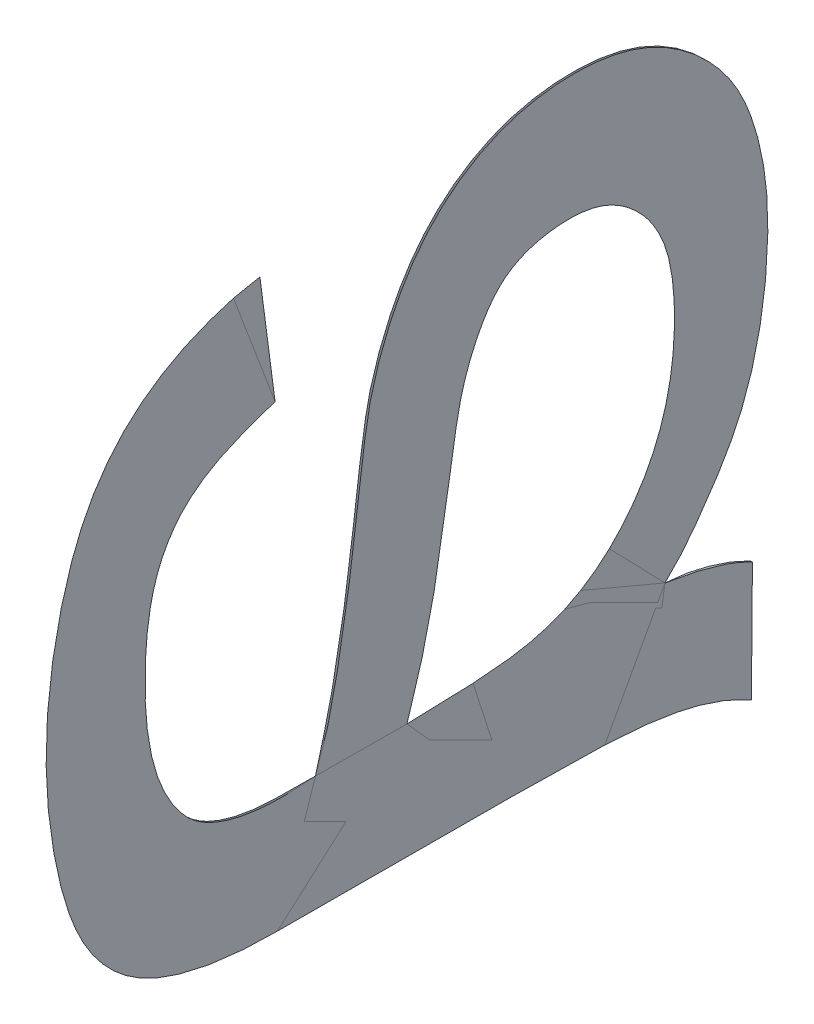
ISO-10303-21;
HEADER;
FILE_DESCRIPTION(('STEP AP214'),'2;1');
FILE_NAME('part.step','',(''),(''),'','','');
FILE_SCHEMA(('AUTOMOTIVE_DESIGN { 1 0 10303 214 1 1 1 1 }'));
ENDSEC;
DATA;
#1=APPLICATION_CONTEXT('core data for automotive mechanical design processes');
#2=APPLICATION_PROTOCOL_DEFINITION('international standard','automotive_design',2000,#1);
#3=PRODUCT_CONTEXT('',#1,'mechanical');
#4=PRODUCT('Part','Part','',(#3));
#5=PRODUCT_RELATED_PRODUCT_CATEGORY('part','',(#4));
#6=PRODUCT_DEFINITION_FORMATION('','',#4);
#7=PRODUCT_DEFINITION_CONTEXT('part definition',#1,'design');
#8=PRODUCT_DEFINITION('design','',#6,#7);
#9=PRODUCT_DEFINITION_SHAPE('','',#8);
#10=(LENGTH_UNIT() NAMED_UNIT(*) SI_UNIT(.MILLI.,.METRE.));
#11=(NAMED_UNIT(*) PLANE_ANGLE_UNIT() SI_UNIT($,.RADIAN.));
#12=(NAMED_UNIT(*) SI_UNIT($,.STERADIAN.) SOLID_ANGLE_UNIT());
#13=UNCERTAINTY_MEASURE_WITH_UNIT(LENGTH_MEASURE(1.E-05),#10,'distance_accuracy_value','');
#14=(GEOMETRIC_REPRESENTATION_CONTEXT(3) GLOBAL_UNCERTAINTY_ASSIGNED_CONTEXT((#13)) GLOBAL_UNIT_ASSIGNED_CONTEXT((#10,
#11,#12)) REPRESENTATION_CONTEXT('',''));
#15=CARTESIAN_POINT('',(0.,0.,0.));
#16=DIRECTION('',(0.,0.,1.));
#17=DIRECTION('',(1.,0.,0.));
#18=AXIS2_PLACEMENT_3D('',#15,#16,#17);
#19=CARTESIAN_POINT('',(-5.56,-3.196945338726,17.194212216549));
#20=CARTESIAN_POINT('',(-5.55,-3.196945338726,17.194212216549));
#21=CARTESIAN_POINT('',(-5.56,-3.132636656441,17.316398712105));
#22=CARTESIAN_POINT('',(-5.55,-3.132636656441,17.316398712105));
#23=CARTESIAN_POINT('',(-5.56,-3.09083601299,17.464308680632));
#24=CARTESIAN_POINT('',(-5.55,-3.09083601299,17.464308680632));
#25=CARTESIAN_POINT('',(-5.56,-3.071543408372,17.634726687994));
#26=CARTESIAN_POINT('',(-5.55,-3.071543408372,17.634726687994));
#27=B_SPLINE_SURFACE_WITH_KNOTS('',3,1,((#19,#20),(#21,#22),(#23,#24),(#25,#26)),.UNSPECIFIED.,
.F.,.F.,.F.,(4,4),(2,2),(0.973259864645,0.999999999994),(0.,1.),.UNSPECIFIED.);
#28=CARTESIAN_POINT('',(-5.56,-3.196945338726,17.194212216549));
#29=CARTESIAN_POINT('',(-5.56,-3.132636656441,17.316398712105));
#30=CARTESIAN_POINT('',(-5.56,-3.09083601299,17.464308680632));
#31=CARTESIAN_POINT('',(-5.56,-3.071543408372,17.634726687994));
#32=B_SPLINE_CURVE_WITH_KNOTS('',3,(#28,#29,#30,#31),.UNSPECIFIED.,.F.,.F.,(4,4),
(0.973259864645,0.999999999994),.UNSPECIFIED.);
#33=CARTESIAN_POINT('',(-5.555,-3.07154340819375,17.6347266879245));
#34=VERTEX_POINT('',#33);
#35=CARTESIAN_POINT('',(-5.56,-3.19694533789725,17.1942122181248));
#36=VERTEX_POINT('',#35);
#37=EDGE_CURVE('E74',#34,#36,#32,.F.);
#38=CARTESIAN_POINT('',(-5.55,-3.071543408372,17.634726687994));
#39=CARTESIAN_POINT('',(-5.55,-3.09083601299,17.464308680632));
#40=CARTESIAN_POINT('',(-5.55,-3.132636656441,17.316398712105));
#41=CARTESIAN_POINT('',(-5.55,-3.196945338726,17.194212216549));
#42=B_SPLINE_CURVE_WITH_KNOTS('',3,(#38,#39,#40,#41),.UNSPECIFIED.,.F.,.F.,(4,4),
(0.973259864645,0.999999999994),.UNSPECIFIED.);
#43=CARTESIAN_POINT('',(-5.55,-3.19694533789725,17.1942122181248));
#44=VERTEX_POINT('',#43);
#45=EDGE_CURVE('E72',#34,#44,#42,.T.);
#46=DIRECTION('',(-1.,0.,0.));
#47=VECTOR('',#46,1.);
#48=CARTESIAN_POINT('',(-5.56,-3.196945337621,17.19421221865));
#49=LINE('',#48,#47);
#50=EDGE_CURVE('E60',#36,#44,#49,.F.);
#51=ORIENTED_EDGE('',*,*,#37,.F.);
#52=ORIENTED_EDGE('',*,*,#45,.T.);
#53=ORIENTED_EDGE('',*,*,#50,.F.);
#54=EDGE_LOOP('',(#51,#52,#53));
#55=FACE_BOUND('',#54,.T.);
#56=ADVANCED_FACE('F17',(#55),#27,.T.);
#57=CARTESIAN_POINT('',(-5.56,-3.807877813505,17.19421221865));
#58=DIRECTION('',(0.,0.,-1.));
#59=DIRECTION('',(-1.,0.,0.));
#60=AXIS2_PLACEMENT_3D('',#57,#58,#59);
#61=PLANE('',#60);
#62=DIRECTION('',(0.,-1.,0.));
#63=VECTOR('',#62,1.);
#64=CARTESIAN_POINT('',(-5.56,-3.117363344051,17.19421221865));
#65=LINE('',#64,#63);
#66=CARTESIAN_POINT('',(-5.555,-3.807877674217,17.194212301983));
#67=VERTEX_POINT('',#66);
#68=EDGE_CURVE('E67',#36,#67,#65,.T.);
#69=ORIENTED_EDGE('',*,*,#68,.F.);
#70=ORIENTED_EDGE('',*,*,#50,.T.);
#71=DIRECTION('',(0.,-1.,0.));
#72=VECTOR('',#71,1.);
#73=CARTESIAN_POINT('',(-5.55,-3.117363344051,17.19421221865));
#74=LINE('',#73,#72);
#75=EDGE_CURVE('E64',#44,#67,#74,.T.);
#76=ORIENTED_EDGE('',*,*,#75,.T.);
#77=EDGE_LOOP('',(#69,#70,#76));
#78=FACE_BOUND('',#77,.T.);
#79=ADVANCED_FACE('F62',(#78),#61,.T.);
#80=CARTESIAN_POINT('',(-5.55,-1.277331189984,19.621864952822));
#81=CARTESIAN_POINT('',(-5.56,-1.277331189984,19.621864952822));
#82=CARTESIAN_POINT('',(-5.55,-1.312781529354,19.758348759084));
#83=CARTESIAN_POINT('',(-5.56,-1.312781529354,19.758348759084));
#84=CARTESIAN_POINT('',(-5.55,-1.404553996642,19.991133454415));
#85=CARTESIAN_POINT('',(-5.56,-1.404553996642,19.991133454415));
#86=CARTESIAN_POINT('',(-5.55,-1.600817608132,20.185845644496));
#87=CARTESIAN_POINT('',(-5.56,-1.600817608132,20.185845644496));
#88=CARTESIAN_POINT('',(-5.55,-1.879083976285,20.283423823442));
#89=CARTESIAN_POINT('',(-5.56,-1.879083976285,20.283423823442));
#90=CARTESIAN_POINT('',(-5.55,-2.315164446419,20.300141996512));
#91=CARTESIAN_POINT('',(-5.56,-2.315164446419,20.300141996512));
#92=CARTESIAN_POINT('',(-5.55,-2.661011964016,20.235659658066));
#93=CARTESIAN_POINT('',(-5.56,-2.661011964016,20.235659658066));
#94=CARTESIAN_POINT('',(-5.55,-2.874229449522,20.101931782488));
#95=CARTESIAN_POINT('',(-5.56,-2.874229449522,20.101931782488));
#96=CARTESIAN_POINT('',(-5.55,-2.96237233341,19.973442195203));
#97=CARTESIAN_POINT('',(-5.56,-2.96237233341,19.973442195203));
#98=CARTESIAN_POINT('',(-5.55,-3.010542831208,19.846722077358));
#99=CARTESIAN_POINT('',(-5.56,-3.010542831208,19.846722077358));
#100=CARTESIAN_POINT('',(-5.55,-3.031556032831,19.714673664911));
#101=CARTESIAN_POINT('',(-5.56,-3.031556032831,19.714673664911));
#102=CARTESIAN_POINT('',(-5.55,-3.036276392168,19.604745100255));
#103=CARTESIAN_POINT('',(-5.56,-3.036276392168,19.604745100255));
#104=CARTESIAN_POINT('',(-5.55,-3.037397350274,19.527055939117));
#105=CARTESIAN_POINT('',(-5.56,-3.037397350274,19.527055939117));
#106=CARTESIAN_POINT('',(-5.55,-3.032958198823,19.416077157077));
#107=CARTESIAN_POINT('',(-5.56,-3.032958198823,19.416077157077));
#108=B_SPLINE_SURFACE_WITH_KNOTS('',3,1,((#80,#81),(#82,#83),(#84,#85),(#86,#87),(#88,#89),(#90,
#91),(#92,#93),(#94,#95),(#96,#97),(#98,#99),(#100,#101),(#102,#103),(#104,#105),(#106,#107)),
.UNSPECIFIED.,.F.,.F.,.F.,(4,1,1,1,1,1,1,1,1,1,1,4),(2,2),(0.361874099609,0.381421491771,
0.400968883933,0.420516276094,0.440063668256,0.459611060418,0.47915845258,0.488932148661,
0.498705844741,0.508479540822,0.513366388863,0.518253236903),(0.,1.),.UNSPECIFIED.);
#109=CARTESIAN_POINT('',(-5.56,-3.032958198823,19.416077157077));
#110=CARTESIAN_POINT('',(-5.56,-3.037397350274,19.527055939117));
#111=CARTESIAN_POINT('',(-5.56,-3.036276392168,19.604745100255));
#112=CARTESIAN_POINT('',(-5.56,-3.031556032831,19.714673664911));
#113=CARTESIAN_POINT('',(-5.56,-3.010542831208,19.846722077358));
#114=CARTESIAN_POINT('',(-5.56,-2.96237233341,19.973442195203));
#115=CARTESIAN_POINT('',(-5.56,-2.874229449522,20.101931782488));
#116=CARTESIAN_POINT('',(-5.56,-2.661011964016,20.235659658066));
#117=CARTESIAN_POINT('',(-5.56,-2.315164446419,20.300141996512));
#118=CARTESIAN_POINT('',(-5.56,-1.879083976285,20.283423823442));
#119=CARTESIAN_POINT('',(-5.56,-1.600817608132,20.185845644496));
#120=CARTESIAN_POINT('',(-5.56,-1.404553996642,19.991133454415));
#121=CARTESIAN_POINT('',(-5.56,-1.312781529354,19.758348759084));
#122=CARTESIAN_POINT('',(-5.56,-1.277331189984,19.621864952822));
#123=B_SPLINE_CURVE_WITH_KNOTS('',3,(#109,#110,#111,#112,#113,#114,#115,#116,#117,#118,#119,
#120,#121,#122),.UNSPECIFIED.,.F.,.F.,(4,1,1,1,1,1,1,1,1,1,1,4),(0.361874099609,0.366760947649,
0.37164779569,0.381421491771,0.391195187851,0.400968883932,0.420516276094,0.440063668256,
0.459611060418,0.479158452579,0.498705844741,0.518253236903),.UNSPECIFIED.);
#124=CARTESIAN_POINT('',(-5.555,-1.277331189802,19.62186495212));
#125=VERTEX_POINT('',#124);
#126=CARTESIAN_POINT('',(-5.555,-3.0329581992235,19.4160771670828));
#127=VERTEX_POINT('',#126);
#128=EDGE_CURVE('E114',#125,#127,#123,.F.);
#129=CARTESIAN_POINT('',(-5.55,-1.277331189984,19.621864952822));
#130=CARTESIAN_POINT('',(-5.55,-1.312781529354,19.758348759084));
#131=CARTESIAN_POINT('',(-5.55,-1.404553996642,19.991133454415));
#132=CARTESIAN_POINT('',(-5.55,-1.600817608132,20.185845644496));
#133=CARTESIAN_POINT('',(-5.55,-1.879083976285,20.283423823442));
#134=CARTESIAN_POINT('',(-5.55,-2.315164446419,20.300141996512));
#135=CARTESIAN_POINT('',(-5.55,-2.661011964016,20.235659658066));
#136=CARTESIAN_POINT('',(-5.55,-2.874229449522,20.101931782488));
#137=CARTESIAN_POINT('',(-5.55,-2.96237233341,19.973442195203));
#138=CARTESIAN_POINT('',(-5.55,-3.010542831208,19.846722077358));
#139=CARTESIAN_POINT('',(-5.55,-3.031556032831,19.714673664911));
#140=CARTESIAN_POINT('',(-5.55,-3.036276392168,19.604745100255));
#141=CARTESIAN_POINT('',(-5.55,-3.037397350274,19.527055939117));
#142=CARTESIAN_POINT('',(-5.55,-3.032958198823,19.416077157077));
#143=B_SPLINE_CURVE_WITH_KNOTS('',3,(#129,#130,#131,#132,#133,#134,#135,#136,#137,#138,#139,
#140,#141,#142),.UNSPECIFIED.,.F.,.F.,(4,1,1,1,1,1,1,1,1,1,1,4),(0.361874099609,0.381421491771,
0.400968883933,0.420516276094,0.440063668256,0.459611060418,0.47915845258,0.488932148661,
0.498705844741,0.508479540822,0.513366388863,0.518253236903),.UNSPECIFIED.);
#144=EDGE_CURVE('E88',#125,#127,#143,.T.);
#145=ORIENTED_EDGE('',*,*,#128,.F.);
#146=ORIENTED_EDGE('',*,*,#144,.T.);
#147=EDGE_LOOP('',(#145,#146));
#148=FACE_BOUND('',#147,.T.);
#149=ADVANCED_FACE('F120',(#148),#108,.T.);
#150=CARTESIAN_POINT('',(-5.55,-3.032958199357,19.416077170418));
#151=CARTESIAN_POINT('',(-5.56,-3.032958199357,19.416077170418));
#152=CARTESIAN_POINT('',(-5.55,-2.870967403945,19.358223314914));
#153=CARTESIAN_POINT('',(-5.56,-2.870967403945,19.358223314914));
#154=CARTESIAN_POINT('',(-5.55,-2.581627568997,19.294592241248));
#155=CARTESIAN_POINT('',(-5.56,-2.581627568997,19.294592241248));
#156=CARTESIAN_POINT('',(-5.55,-2.117571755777,19.227717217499));
#157=CARTESIAN_POINT('',(-5.56,-2.117571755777,19.227717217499));
#158=CARTESIAN_POINT('',(-5.55,-1.854610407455,19.196613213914));
#159=CARTESIAN_POINT('',(-5.56,-1.854610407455,19.196613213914));
#160=CARTESIAN_POINT('',(-5.55,-1.637302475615,19.165659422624));
#161=CARTESIAN_POINT('',(-5.56,-1.637302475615,19.165659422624));
#162=CARTESIAN_POINT('',(-5.55,-1.438619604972,19.130729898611));
#163=CARTESIAN_POINT('',(-5.56,-1.438619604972,19.130729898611));
#164=CARTESIAN_POINT('',(-5.55,-1.121253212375,19.01358324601));
#165=CARTESIAN_POINT('',(-5.56,-1.121253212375,19.01358324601));
#166=CARTESIAN_POINT('',(-5.55,-0.818599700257,18.79121136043));
#167=CARTESIAN_POINT('',(-5.56,-0.818599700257,18.79121136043));
#168=CARTESIAN_POINT('',(-5.55,-0.611551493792,18.449379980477));
#169=CARTESIAN_POINT('',(-5.56,-0.611551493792,18.449379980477));
#170=CARTESIAN_POINT('',(-5.55,-0.564954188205,18.023035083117));
#171=CARTESIAN_POINT('',(-5.56,-0.564954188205,18.023035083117));
#172=CARTESIAN_POINT('',(-5.55,-0.662679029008,17.653856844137));
#173=CARTESIAN_POINT('',(-5.56,-0.662679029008,17.653856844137));
#174=CARTESIAN_POINT('',(-5.55,-0.919456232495,17.350159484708));
#175=CARTESIAN_POINT('',(-5.56,-0.919456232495,17.350159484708));
#176=CARTESIAN_POINT('',(-5.55,-1.195300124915,17.196312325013));
#177=CARTESIAN_POINT('',(-5.56,-1.195300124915,17.196312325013));
#178=CARTESIAN_POINT('',(-5.55,-1.687832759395,17.078513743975));
#179=CARTESIAN_POINT('',(-5.56,-1.687832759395,17.078513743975));
#180=CARTESIAN_POINT('',(-5.55,-2.336176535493,17.15336348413));
#181=CARTESIAN_POINT('',(-5.56,-2.336176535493,17.15336348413));
#182=CARTESIAN_POINT('',(-5.55,-2.737993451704,17.368354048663));
#183=CARTESIAN_POINT('',(-5.56,-2.737993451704,17.368354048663));
#184=CARTESIAN_POINT('',(-5.55,-2.96136535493,17.536234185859));
#185=CARTESIAN_POINT('',(-5.56,-2.96136535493,17.536234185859));
#186=CARTESIAN_POINT('',(-5.55,-3.071543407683,17.634726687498));
#187=CARTESIAN_POINT('',(-5.56,-3.071543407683,17.634726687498));
#188=B_SPLINE_SURFACE_WITH_KNOTS('',3,1,((#150,#151),(#152,#153),(#154,#155),(#156,#157),(#158,
#159),(#160,#161),(#162,#163),(#164,#165),(#166,#167),(#168,#169),(#170,#171),(#172,#173),(#174,
#175),(#176,#177),(#178,#179),(#180,#181),(#182,#183),(#184,#185),(#186,#187)),.UNSPECIFIED.,
.F.,.F.,.F.,(4,1,1,1,1,1,1,1,1,1,1,1,1,1,1,1,4),(2,2),(0.,0.04523426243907,0.05654282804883,
0.0678513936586,0.07915995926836,0.09046852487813,0.113085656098,0.135702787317,0.158319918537,
0.180937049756,0.203554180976,0.226171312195,0.248788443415,0.271405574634,0.316639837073,
0.339256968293,0.361874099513),(0.,1.),.UNSPECIFIED.);
#189=CARTESIAN_POINT('',(-5.56,-3.071543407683,17.634726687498));
#190=CARTESIAN_POINT('',(-5.56,-2.96136535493,17.536234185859));
#191=CARTESIAN_POINT('',(-5.56,-2.737993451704,17.368354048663));
#192=CARTESIAN_POINT('',(-5.56,-2.336176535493,17.15336348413));
#193=CARTESIAN_POINT('',(-5.56,-1.687832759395,17.078513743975));
#194=CARTESIAN_POINT('',(-5.56,-1.195300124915,17.196312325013));
#195=CARTESIAN_POINT('',(-5.56,-0.919456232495,17.350159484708));
#196=CARTESIAN_POINT('',(-5.56,-0.662679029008,17.653856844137));
#197=CARTESIAN_POINT('',(-5.56,-0.564954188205,18.023035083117));
#198=CARTESIAN_POINT('',(-5.56,-0.611551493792,18.449379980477));
#199=CARTESIAN_POINT('',(-5.56,-0.818599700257,18.79121136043));
#200=CARTESIAN_POINT('',(-5.56,-1.121253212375,19.01358324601));
#201=CARTESIAN_POINT('',(-5.56,-1.438619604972,19.130729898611));
#202=CARTESIAN_POINT('',(-5.56,-1.637302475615,19.165659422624));
#203=CARTESIAN_POINT('',(-5.56,-1.854610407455,19.196613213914));
#204=CARTESIAN_POINT('',(-5.56,-2.117571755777,19.227717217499));
#205=CARTESIAN_POINT('',(-5.56,-2.581627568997,19.294592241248));
#206=CARTESIAN_POINT('',(-5.56,-2.870967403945,19.358223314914));
#207=CARTESIAN_POINT('',(-5.56,-3.032958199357,19.416077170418));
#208=B_SPLINE_CURVE_WITH_KNOTS('',3,(#189,#190,#191,#192,#193,#194,#195,#196,#197,#198,#199,
#200,#201,#202,#203,#204,#205,#206,#207),.UNSPECIFIED.,.F.,.F.,(4,1,1,1,1,1,1,1,1,1,1,1,1,1,1,1,
4),(0.,0.02261713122,0.04523426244,0.090468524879,0.113085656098,0.135702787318,0.158319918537,
0.180937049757,0.203554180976,0.226171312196,0.248788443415,0.27140557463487,0.28271414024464,
0.2940227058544,0.30533127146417,0.31663983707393,0.361874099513),.UNSPECIFIED.);
#209=EDGE_CURVE('E101',#127,#34,#208,.F.);
#210=CARTESIAN_POINT('',(-5.55,-3.032958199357,19.416077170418));
#211=CARTESIAN_POINT('',(-5.55,-2.870967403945,19.358223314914));
#212=CARTESIAN_POINT('',(-5.55,-2.581627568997,19.294592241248));
#213=CARTESIAN_POINT('',(-5.55,-2.117571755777,19.227717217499));
#214=CARTESIAN_POINT('',(-5.55,-1.854610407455,19.196613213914));
#215=CARTESIAN_POINT('',(-5.55,-1.637302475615,19.165659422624));
#216=CARTESIAN_POINT('',(-5.55,-1.438619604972,19.130729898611));
#217=CARTESIAN_POINT('',(-5.55,-1.121253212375,19.01358324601));
#218=CARTESIAN_POINT('',(-5.55,-0.818599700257,18.79121136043));
#219=CARTESIAN_POINT('',(-5.55,-0.611551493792,18.449379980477));
#220=CARTESIAN_POINT('',(-5.55,-0.564954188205,18.023035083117));
#221=CARTESIAN_POINT('',(-5.55,-0.662679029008,17.653856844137));
#222=CARTESIAN_POINT('',(-5.55,-0.919456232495,17.350159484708));
#223=CARTESIAN_POINT('',(-5.55,-1.195300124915,17.196312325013));
#224=CARTESIAN_POINT('',(-5.55,-1.687832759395,17.078513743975));
#225=CARTESIAN_POINT('',(-5.55,-2.336176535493,17.15336348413));
#226=CARTESIAN_POINT('',(-5.55,-2.737993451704,17.368354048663));
#227=CARTESIAN_POINT('',(-5.55,-2.96136535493,17.536234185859));
#228=CARTESIAN_POINT('',(-5.55,-3.071543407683,17.634726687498));
#229=B_SPLINE_CURVE_WITH_KNOTS('',3,(#210,#211,#212,#213,#214,#215,#216,#217,#218,#219,#220,
#221,#222,#223,#224,#225,#226,#227,#228),.UNSPECIFIED.,.F.,.F.,(4,1,1,1,1,1,1,1,1,1,1,1,1,1,1,1,
4),(0.,0.04523426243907,0.05654282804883,0.0678513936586,0.07915995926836,0.09046852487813,
0.113085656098,0.135702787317,0.158319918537,0.180937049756,0.203554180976,0.226171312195,
0.248788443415,0.271405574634,0.316639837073,0.339256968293,0.361874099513),.UNSPECIFIED.);
#230=EDGE_CURVE('E81',#127,#34,#229,.T.);
#231=ORIENTED_EDGE('',*,*,#209,.F.);
#232=ORIENTED_EDGE('',*,*,#230,.T.);
#233=EDGE_LOOP('',(#231,#232));
#234=FACE_BOUND('',#233,.T.);
#235=ADVANCED_FACE('F19',(#234),#188,.T.);
#236=CARTESIAN_POINT('',(-5.55,-3.117363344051,17.396382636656));
#237=DIRECTION('',(-1.,0.,0.));
#238=DIRECTION('',(0.,-1.,0.));
#239=AXIS2_PLACEMENT_3D('',#236,#237,#238);
#240=PLANE('',#239);
#241=CARTESIAN_POINT('',(-5.56,-1.402733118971,17.737620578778));
#242=CARTESIAN_POINT('',(-5.56,-1.27051866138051,17.8519682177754));
#243=CARTESIAN_POINT('',(-5.56,-1.23796662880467,18.0007028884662));
#244=CARTESIAN_POINT('',(-5.56,-1.22136398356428,18.0765626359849));
#245=CARTESIAN_POINT('',(-5.56,-1.2276486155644,18.166657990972));
#246=CARTESIAN_POINT('',(-5.56,-1.23352904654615,18.2509587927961));
#247=CARTESIAN_POINT('',(-5.56,-1.2581893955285,18.3242168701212));
#248=CARTESIAN_POINT('',(-5.56,-1.28446907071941,18.402285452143));
#249=CARTESIAN_POINT('',(-5.56,-1.33418887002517,18.4585954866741));
#250=CARTESIAN_POINT('',(-5.56,-1.38076498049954,18.5113451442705));
#251=CARTESIAN_POINT('',(-5.56,-1.46123118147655,18.5580406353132));
#252=CARTESIAN_POINT('',(-5.56,-1.57691503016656,18.6251733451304));
#253=CARTESIAN_POINT('',(-5.56,-1.72169290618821,18.6648885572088));
#254=CARTESIAN_POINT('',(-5.56,-1.78202382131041,18.6814384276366));
#255=CARTESIAN_POINT('',(-5.56,-1.88444173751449,18.6988036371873));
#256=CARTESIAN_POINT('',(-5.56,-1.94318319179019,18.7087633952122));
#257=CARTESIAN_POINT('',(-5.56,-2.09876639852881,18.733232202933));
#258=CARTESIAN_POINT('',(-5.56,-2.36036304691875,18.7743739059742));
#259=CARTESIAN_POINT('',(-5.56,-2.48002097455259,18.797342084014));
#260=CARTESIAN_POINT('',(-5.56,-2.81941198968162,18.8624877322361));
#261=CARTESIAN_POINT('',(-5.56,-3.03617337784,18.949838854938));
#262=B_SPLINE_CURVE_WITH_KNOTS('',2,(#241,#242,#243,#244,#245,#246,#247,#248,#249,#250,#251,
#252,#253,#254,#255,#256,#257,#258,#259,#260,#261),.UNSPECIFIED.,.F.,.F.,(3,2,2,2,2,2,2,2,2,2,
3),(0.,0.125,0.1875,0.25,0.321428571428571,0.392857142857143,0.5,0.5625,0.625,0.75,1.),.UNSPECIFIED.);
#263=CARTESIAN_POINT('',(-5.555,-1.402733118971,17.737620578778));
#264=VERTEX_POINT('',#263);
#265=CARTESIAN_POINT('',(-5.555,-3.03617337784,18.949838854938));
#266=VERTEX_POINT('',#265);
#267=EDGE_CURVE('E11',#264,#266,#262,.T.);
#268=ORIENTED_EDGE('',*,*,#267,.F.);
#269=CARTESIAN_POINT('',(-5.56,-3.03617337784,18.949838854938));
#270=CARTESIAN_POINT('',(-5.56,-3.03136296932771,18.6274905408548));
#271=CARTESIAN_POINT('',(-5.56,-3.02975155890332,18.5977643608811));
#272=CARTESIAN_POINT('',(-5.56,-3.01904449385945,18.4002478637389));
#273=CARTESIAN_POINT('',(-5.56,-2.98315725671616,18.2680828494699));
#274=CARTESIAN_POINT('',(-5.56,-2.90340645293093,17.9743777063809));
#275=CARTESIAN_POINT('',(-5.56,-2.63198054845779,17.7825147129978));
#276=CARTESIAN_POINT('',(-5.56,-2.37869515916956,17.6034747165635));
#277=CARTESIAN_POINT('',(-5.56,-2.02370172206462,17.5837806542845));
#278=CARTESIAN_POINT('',(-5.56,-1.81836840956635,17.5723893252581));
#279=CARTESIAN_POINT('',(-5.56,-1.66285841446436,17.6084508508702));
#280=CARTESIAN_POINT('',(-5.56,-1.5115035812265,17.6435488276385));
#281=CARTESIAN_POINT('',(-5.56,-1.402733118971,17.737620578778));
#282=B_SPLINE_CURVE_WITH_KNOTS('',2,(#269,#270,#271,#272,#273,#274,#275,#276,#277,#278,#279,
#280,#281),.UNSPECIFIED.,.F.,.F.,(3,2,2,2,2,2,3),(0.,0.125,0.25,0.5,0.75,0.875,1.),.UNSPECIFIED.);
#283=EDGE_CURVE('E31',#266,#264,#282,.T.);
#284=ORIENTED_EDGE('',*,*,#283,.F.);
#285=EDGE_LOOP('',(#268,#284));
#286=FACE_BOUND('',#285,.T.);
#287=ORIENTED_EDGE('',*,*,#230,.F.);
#288=ORIENTED_EDGE('',*,*,#144,.F.);
#289=CARTESIAN_POINT('',(-5.56,-0.688907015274,19.699035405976));
#290=DIRECTION('',(0.,-0.991509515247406,-0.130034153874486));
#291=VECTOR('',#290,1.);
#292=LINE('',#289,#291);
#293=CARTESIAN_POINT('',(-5.555,-0.688907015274,19.699035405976));
#294=VERTEX_POINT('',#293);
#295=EDGE_CURVE('E223',#294,#125,#292,.T.);
#296=ORIENTED_EDGE('',*,*,#295,.F.);
#297=CARTESIAN_POINT('',(-5.56,-3.807877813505,17.19421221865));
#298=CARTESIAN_POINT('',(-5.56,-3.73186062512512,17.3358806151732));
#299=CARTESIAN_POINT('',(-5.56,-3.69377414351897,17.4951443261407));
#300=CARTESIAN_POINT('',(-5.56,-3.65554916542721,17.654987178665));
#301=CARTESIAN_POINT('',(-5.56,-3.64247592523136,17.8555986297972));
#302=CARTESIAN_POINT('',(-5.56,-3.62861985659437,18.0682227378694));
#303=CARTESIAN_POINT('',(-5.56,-3.6278135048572,18.8249934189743));
#304=CARTESIAN_POINT('',(-5.56,-3.62694240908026,19.6425271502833));
#305=CARTESIAN_POINT('',(-5.56,-3.6239040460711,19.7092800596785));
#306=CARTESIAN_POINT('',(-5.56,-3.61791538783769,19.8408510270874));
#307=CARTESIAN_POINT('',(-5.56,-3.6042305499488,19.9270893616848));
#308=CARTESIAN_POINT('',(-5.56,-3.5882672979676,20.0276856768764));
#309=CARTESIAN_POINT('',(-5.56,-3.56175645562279,20.1166843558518));
#310=CARTESIAN_POINT('',(-5.56,-3.50987723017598,20.2908464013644));
#311=CARTESIAN_POINT('',(-5.56,-3.40840647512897,20.4112313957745));
#312=CARTESIAN_POINT('',(-5.56,-3.29624906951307,20.5442950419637));
#313=CARTESIAN_POINT('',(-5.56,-3.12215321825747,20.6244048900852));
#314=CARTESIAN_POINT('',(-5.56,-2.9533942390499,20.7020589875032));
#315=CARTESIAN_POINT('',(-5.56,-2.6953807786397,20.7468933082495));
#316=CARTESIAN_POINT('',(-5.56,-2.25630814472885,20.8231898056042));
#317=CARTESIAN_POINT('',(-5.56,-1.81127456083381,20.7413472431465));
#318=CARTESIAN_POINT('',(-5.56,-1.56509046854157,20.6960734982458));
#319=CARTESIAN_POINT('',(-5.56,-1.38283008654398,20.6195350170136));
#320=CARTESIAN_POINT('',(-5.56,-1.19351283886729,20.5400330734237));
#321=CARTESIAN_POINT('',(-5.56,-1.05552343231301,20.4130878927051));
#322=CARTESIAN_POINT('',(-5.56,-0.918969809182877,20.2874635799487));
#323=CARTESIAN_POINT('',(-5.56,-0.828386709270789,20.1112840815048));
#324=CARTESIAN_POINT('',(-5.56,-0.738066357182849,19.9356156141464));
#325=CARTESIAN_POINT('',(-5.56,-0.688907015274,19.699035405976));
#326=B_SPLINE_CURVE_WITH_KNOTS('',2,(#297,#298,#299,#300,#301,#302,#303,#304,#305,#306,#307,
#308,#309,#310,#311,#312,#313,#314,#315,#316,#317,#318,#319,#320,#321,#322,#323,#324,#325),
.UNSPECIFIED.,.F.,.F.,(3,2,2,2,2,2,2,2,2,2,2,2,2,2,3),(0.,0.0625,0.125,0.25,0.375,0.40625,
0.4375,0.5,0.5625,0.625,0.75,0.8125,0.875,0.9375,1.),.UNSPECIFIED.);
#327=EDGE_CURVE('E86',#67,#294,#326,.T.);
#328=ORIENTED_EDGE('',*,*,#327,.F.);
#329=ORIENTED_EDGE('',*,*,#75,.F.);
#330=ORIENTED_EDGE('',*,*,#45,.F.);
#331=EDGE_LOOP('',(#287,#288,#296,#328,#329,#330));
#332=FACE_BOUND('',#331,.T.);
#333=ADVANCED_FACE('F84',(#286,#332),#240,.F.);
#334=CARTESIAN_POINT('',(-5.56,-3.117363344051,17.396382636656));
#335=DIRECTION('',(-1.,0.,0.));
#336=DIRECTION('',(0.,-1.,0.));
#337=AXIS2_PLACEMENT_3D('',#334,#335,#336);
#338=PLANE('',#337);
#339=ORIENTED_EDGE('',*,*,#283,.T.);
#340=ORIENTED_EDGE('',*,*,#267,.T.);
#341=EDGE_LOOP('',(#339,#340));
#342=FACE_BOUND('',#341,.T.);
#343=ORIENTED_EDGE('',*,*,#128,.T.);
#344=ORIENTED_EDGE('',*,*,#209,.T.);
#345=ORIENTED_EDGE('',*,*,#37,.T.);
#346=ORIENTED_EDGE('',*,*,#68,.T.);
#347=ORIENTED_EDGE('',*,*,#327,.T.);
#348=ORIENTED_EDGE('',*,*,#295,.T.);
#349=EDGE_LOOP('',(#343,#344,#345,#346,#347,#348));
#350=FACE_BOUND('',#349,.T.);
#351=ADVANCED_FACE('F183',(#342,#350),#338,.T.);
#352=CLOSED_SHELL('',(#56,#79,#149,#235,#333,#351));
#353=MANIFOLD_SOLID_BREP('B1',#352);
#354=ADVANCED_BREP_SHAPE_REPRESENTATION('',(#18,#353),#14);
#355=SHAPE_DEFINITION_REPRESENTATION(#9,#354);
ENDSEC;
END-ISO-10303-21;
